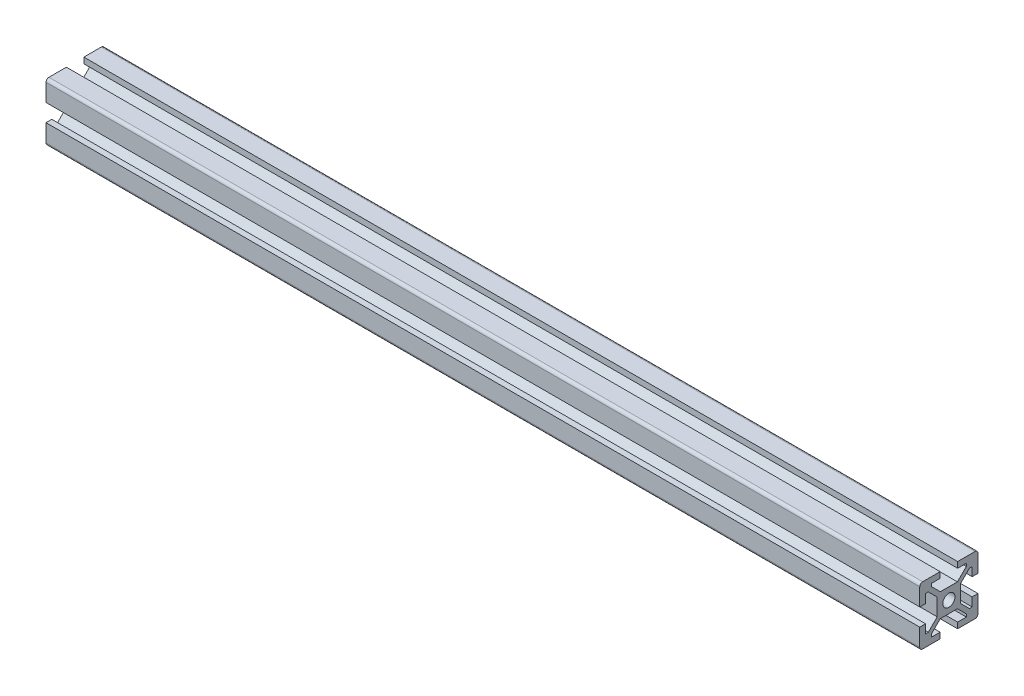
from build123d import *

# Parameters (mm, degrees)
SKETCH1_R           = 2.1
BOSS_EXTRUDE1_DEPTH = 300


with BuildPart() as part:
    # Sketch1 → Boss-Extrude1 (new body)
    with BuildSketch(Plane(origin=(0, 0, 0), x_dir=(0, 0, -1), z_dir=(1, 0, 0))):
        with BuildLine():
            Line((-10, 9), (-10, 3))
            Line((-10, 3), (-8, 3))
            Line((-8, 3), (-8, 6))
            Line((-8, 6), (-7.060660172, 6))
            Line((-7.060660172, 6), (-4, 2.939339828))
            Line((-4, 2.939339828), (-4, -2.939339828))
            Line((-4, -2.939339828), (-7.060660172, -6))
            Line((-7.060660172, -6), (-8, -6))
            Line((-8, -6), (-8, -3))
            Line((-8, -3), (-10, -3))
            Line((-10, -3), (-10, -9))
            ThreePointArc((-10, -9), (-9.707106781, -9.707106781), (-9, -10))
            Line((-9, -10), (-3, -10))
            Line((-3, -10), (-3, -8))
            Line((-3, -8), (-6, -8))
            Line((-6, -8), (-6, -7.060660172))
            Line((-6, -7.060660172), (-2.939339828, -4))
            Line((-2.939339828, -4), (2.939339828, -4))
            Line((2.939339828, -4), (6, -7.060660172))
            Line((6, -7.060660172), (6, -8))
            Line((6, -8), (3, -8))
            Line((3, -8), (3, -10))
            Line((3, -10), (9, -10))
            ThreePointArc((9, -10), (9.707106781, -9.707106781), (10, -9))
            Line((10, -9), (10, -3))
            Line((10, -3), (8, -3))
            Line((8, -3), (8, -6))
            Line((8, -6), (7.060660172, -6))
            Line((7.060660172, -6), (4, -2.939339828))
            Line((4, -2.939339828), (4, 2.939339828))
            Line((4, 2.939339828), (7.060660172, 6))
            Line((7.060660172, 6), (8, 6))
            Line((8, 6), (8, 3))
            Line((8, 3), (10, 3))
            Line((10, 3), (10, 9))
            ThreePointArc((10, 9), (9.707106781, 9.707106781), (9, 10))
            Line((9, 10), (3, 10))
            Line((3, 10), (3, 8))
            Line((3, 8), (6, 8))
            Line((6, 8), (6, 7.060660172))
            Line((6, 7.060660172), (2.939339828, 4))
            Line((2.939339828, 4), (-2.939339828, 4))
            Line((-2.939339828, 4), (-6, 7.060660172))
            Line((-6, 7.060660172), (-6, 8))
            Line((-6, 8), (-3, 8))
            Line((-3, 8), (-3, 10))
            Line((-3, 10), (-9, 10))
            ThreePointArc((-9, 10), (-9.707106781, 9.707106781), (-10, 9))
        make_face()
        Circle(SKETCH1_R, mode=Mode.SUBTRACT)
    extrude(amount=BOSS_EXTRUDE1_DEPTH)


solid = part.part
